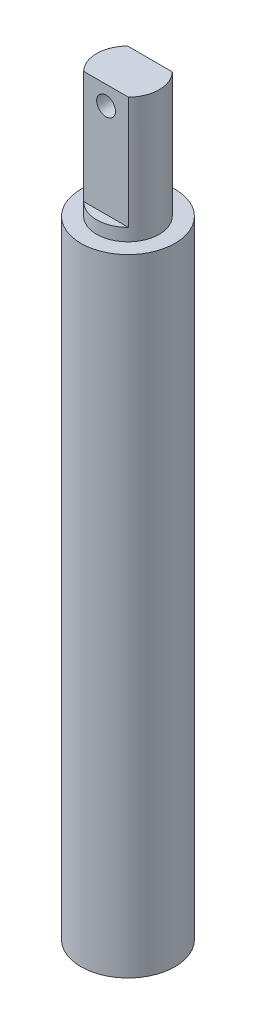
ISO-10303-21;
HEADER;
FILE_DESCRIPTION(('STEP AP214'),'2;1');
FILE_NAME('part.step','',(''),(''),'','','');
FILE_SCHEMA(('AUTOMOTIVE_DESIGN { 1 0 10303 214 1 1 1 1 }'));
ENDSEC;
DATA;
#1=APPLICATION_CONTEXT('core data for automotive mechanical design processes');
#2=APPLICATION_PROTOCOL_DEFINITION('international standard','automotive_design',2000,#1);
#3=PRODUCT_CONTEXT('',#1,'mechanical');
#4=PRODUCT('Part','Part','',(#3));
#5=PRODUCT_RELATED_PRODUCT_CATEGORY('part','',(#4));
#6=PRODUCT_DEFINITION_FORMATION('','',#4);
#7=PRODUCT_DEFINITION_CONTEXT('part definition',#1,'design');
#8=PRODUCT_DEFINITION('design','',#6,#7);
#9=PRODUCT_DEFINITION_SHAPE('','',#8);
#10=(LENGTH_UNIT() NAMED_UNIT(*) SI_UNIT(.MILLI.,.METRE.));
#11=(NAMED_UNIT(*) PLANE_ANGLE_UNIT() SI_UNIT($,.RADIAN.));
#12=(NAMED_UNIT(*) SI_UNIT($,.STERADIAN.) SOLID_ANGLE_UNIT());
#13=UNCERTAINTY_MEASURE_WITH_UNIT(LENGTH_MEASURE(1.E-05),#10,'distance_accuracy_value','');
#14=(GEOMETRIC_REPRESENTATION_CONTEXT(3) GLOBAL_UNCERTAINTY_ASSIGNED_CONTEXT((#13)) GLOBAL_UNIT_ASSIGNED_CONTEXT((#10,
#11,#12)) REPRESENTATION_CONTEXT('',''));
#15=CARTESIAN_POINT('',(0.,0.,0.));
#16=DIRECTION('',(0.,0.,1.));
#17=DIRECTION('',(1.,0.,0.));
#18=AXIS2_PLACEMENT_3D('',#15,#16,#17);
#19=CARTESIAN_POINT('',(0.,120.,0.));
#20=DIRECTION('',(0.,-1.,0.));
#21=DIRECTION('',(0.,0.,-1.));
#22=AXIS2_PLACEMENT_3D('',#19,#20,#21);
#23=CYLINDRICAL_SURFACE('',#22,5.);
#24=CARTESIAN_POINT('',(0.,100.,0.));
#25=DIRECTION('',(0.,1.,0.));
#26=DIRECTION('',(0.,0.,1.));
#27=AXIS2_PLACEMENT_3D('',#24,#25,#26);
#28=CIRCLE('',#27,5.);
#29=CARTESIAN_POINT('',(0.,100.,5.));
#30=VERTEX_POINT('',#29);
#31=EDGE_CURVE('E133',#30,#30,#28,.T.);
#32=ORIENTED_EDGE('',*,*,#31,.T.);
#33=EDGE_LOOP('',(#32));
#34=FACE_BOUND('',#33,.T.);
#35=DIRECTION('',(0.,-1.,0.));
#36=VECTOR('',#35,1.);
#37=CARTESIAN_POINT('',(3.57071421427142,120.,-3.5));
#38=LINE('',#37,#36);
#39=CARTESIAN_POINT('',(3.57071421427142,120.,-3.5));
#40=VERTEX_POINT('',#39);
#41=CARTESIAN_POINT('',(3.57071421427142,102.,-3.5));
#42=VERTEX_POINT('',#41);
#43=EDGE_CURVE('E120',#40,#42,#38,.T.);
#44=ORIENTED_EDGE('',*,*,#43,.F.);
#45=CARTESIAN_POINT('',(0.,120.,0.));
#46=DIRECTION('',(0.,1.,0.));
#47=DIRECTION('',(0.,0.,1.));
#48=AXIS2_PLACEMENT_3D('',#45,#46,#47);
#49=CIRCLE('',#48,5.);
#50=CARTESIAN_POINT('',(3.57071421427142,120.,3.5));
#51=VERTEX_POINT('',#50);
#52=EDGE_CURVE('E104',#51,#40,#49,.T.);
#53=ORIENTED_EDGE('',*,*,#52,.F.);
#54=DIRECTION('',(0.,-1.,0.));
#55=VECTOR('',#54,1.);
#56=CARTESIAN_POINT('',(3.57071421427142,120.,3.5));
#57=LINE('',#56,#55);
#58=CARTESIAN_POINT('',(3.57071421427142,102.,3.5));
#59=VERTEX_POINT('',#58);
#60=EDGE_CURVE('E76',#59,#51,#57,.F.);
#61=ORIENTED_EDGE('',*,*,#60,.F.);
#62=CARTESIAN_POINT('',(0.,102.,0.));
#63=DIRECTION('',(0.,1.,0.));
#64=DIRECTION('',(0.,0.,1.));
#65=AXIS2_PLACEMENT_3D('',#62,#63,#64);
#66=CIRCLE('',#65,5.);
#67=CARTESIAN_POINT('',(-3.57071421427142,102.,3.5));
#68=VERTEX_POINT('',#67);
#69=EDGE_CURVE('E61',#68,#59,#66,.T.);
#70=ORIENTED_EDGE('',*,*,#69,.F.);
#71=DIRECTION('',(0.,-1.,0.));
#72=VECTOR('',#71,1.);
#73=CARTESIAN_POINT('',(-3.57071421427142,120.,3.5));
#74=LINE('',#73,#72);
#75=CARTESIAN_POINT('',(-3.57071421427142,120.,3.5));
#76=VERTEX_POINT('',#75);
#77=EDGE_CURVE('E108',#76,#68,#74,.T.);
#78=ORIENTED_EDGE('',*,*,#77,.F.);
#79=CARTESIAN_POINT('',(-3.57071421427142,120.,-3.5));
#80=VERTEX_POINT('',#79);
#81=EDGE_CURVE('E96',#80,#76,#49,.T.);
#82=ORIENTED_EDGE('',*,*,#81,.F.);
#83=DIRECTION('',(0.,-1.,0.));
#84=VECTOR('',#83,1.);
#85=CARTESIAN_POINT('',(-3.57071421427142,120.,-3.5));
#86=LINE('',#85,#84);
#87=CARTESIAN_POINT('',(-3.57071421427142,102.,-3.5));
#88=VERTEX_POINT('',#87);
#89=EDGE_CURVE('E68',#88,#80,#86,.F.);
#90=ORIENTED_EDGE('',*,*,#89,.F.);
#91=EDGE_CURVE('E12',#42,#88,#66,.T.);
#92=ORIENTED_EDGE('',*,*,#91,.F.);
#93=EDGE_LOOP('',(#44,#53,#61,#70,#78,#82,#90,#92));
#94=FACE_BOUND('',#93,.T.);
#95=ADVANCED_FACE('F51',(#34,#94),#23,.T.);
#96=CARTESIAN_POINT('',(0.,120.,0.));
#97=DIRECTION('',(0.,1.,0.));
#98=DIRECTION('',(0.,0.,1.));
#99=AXIS2_PLACEMENT_3D('',#96,#97,#98);
#100=PLANE('',#99);
#101=ORIENTED_EDGE('',*,*,#52,.T.);
#102=DIRECTION('',(-1.,0.,0.));
#103=VECTOR('',#102,1.);
#104=CARTESIAN_POINT('',(0.,120.,-3.5));
#105=LINE('',#104,#103);
#106=EDGE_CURVE('E100',#40,#80,#105,.T.);
#107=ORIENTED_EDGE('',*,*,#106,.T.);
#108=ORIENTED_EDGE('',*,*,#81,.T.);
#109=DIRECTION('',(1.,0.,0.));
#110=VECTOR('',#109,1.);
#111=CARTESIAN_POINT('',(0.,120.,3.5));
#112=LINE('',#111,#110);
#113=EDGE_CURVE('E98',#76,#51,#112,.T.);
#114=ORIENTED_EDGE('',*,*,#113,.T.);
#115=EDGE_LOOP('',(#101,#107,#108,#114));
#116=FACE_BOUND('',#115,.T.);
#117=ADVANCED_FACE('F97',(#116),#100,.T.);
#118=CARTESIAN_POINT('',(0.,100.,0.));
#119=DIRECTION('',(0.,-1.,0.));
#120=DIRECTION('',(0.,0.,-1.));
#121=AXIS2_PLACEMENT_3D('',#118,#119,#120);
#122=CYLINDRICAL_SURFACE('',#121,5.);
#123=CARTESIAN_POINT('',(0.,0.,0.));
#124=DIRECTION('',(0.,1.,0.));
#125=DIRECTION('',(0.,0.,1.));
#126=AXIS2_PLACEMENT_3D('',#123,#124,#125);
#127=CIRCLE('',#126,5.);
#128=CARTESIAN_POINT('',(0.,0.,5.));
#129=VERTEX_POINT('',#128);
#130=EDGE_CURVE('E129',#129,#129,#127,.T.);
#131=ORIENTED_EDGE('',*,*,#130,.F.);
#132=EDGE_LOOP('',(#131));
#133=FACE_BOUND('',#132,.T.);
#134=CARTESIAN_POINT('',(0.,60.,0.));
#135=DIRECTION('',(0.,1.,0.));
#136=DIRECTION('',(0.,0.,1.));
#137=AXIS2_PLACEMENT_3D('',#134,#135,#136);
#138=CIRCLE('',#137,5.);
#139=CARTESIAN_POINT('',(0.,60.,5.));
#140=VERTEX_POINT('',#139);
#141=EDGE_CURVE('E105',#140,#140,#138,.T.);
#142=ORIENTED_EDGE('',*,*,#141,.T.);
#143=EDGE_LOOP('',(#142));
#144=FACE_BOUND('',#143,.T.);
#145=ADVANCED_FACE('F191',(#133,#144),#122,.F.);
#146=CARTESIAN_POINT('',(0.,100.,0.));
#147=DIRECTION('',(0.,1.,0.));
#148=DIRECTION('',(0.,0.,1.));
#149=AXIS2_PLACEMENT_3D('',#146,#147,#148);
#150=PLANE('',#149);
#151=CARTESIAN_POINT('',(0.,100.,0.));
#152=DIRECTION('',(0.,1.,0.));
#153=DIRECTION('',(0.,0.,1.));
#154=AXIS2_PLACEMENT_3D('',#151,#152,#153);
#155=CIRCLE('',#154,7.5);
#156=CARTESIAN_POINT('',(0.,100.,7.5));
#157=VERTEX_POINT('',#156);
#158=EDGE_CURVE('E111',#157,#157,#155,.T.);
#159=ORIENTED_EDGE('',*,*,#158,.T.);
#160=EDGE_LOOP('',(#159));
#161=FACE_BOUND('',#160,.T.);
#162=ORIENTED_EDGE('',*,*,#31,.F.);
#163=EDGE_LOOP('',(#162));
#164=FACE_BOUND('',#163,.T.);
#165=ADVANCED_FACE('F198',(#161,#164),#150,.T.);
#166=CARTESIAN_POINT('',(0.,0.,0.));
#167=DIRECTION('',(0.,1.,0.));
#168=DIRECTION('',(0.,0.,1.));
#169=AXIS2_PLACEMENT_3D('',#166,#167,#168);
#170=PLANE('',#169);
#171=CARTESIAN_POINT('',(0.,0.,0.));
#172=DIRECTION('',(0.,1.,0.));
#173=DIRECTION('',(0.,0.,1.));
#174=AXIS2_PLACEMENT_3D('',#171,#172,#173);
#175=CIRCLE('',#174,7.5);
#176=CARTESIAN_POINT('',(0.,0.,7.5));
#177=VERTEX_POINT('',#176);
#178=EDGE_CURVE('E137',#177,#177,#175,.T.);
#179=ORIENTED_EDGE('',*,*,#178,.F.);
#180=EDGE_LOOP('',(#179));
#181=FACE_BOUND('',#180,.T.);
#182=ORIENTED_EDGE('',*,*,#130,.T.);
#183=EDGE_LOOP('',(#182));
#184=FACE_BOUND('',#183,.T.);
#185=ADVANCED_FACE('F201',(#181,#184),#170,.F.);
#186=CARTESIAN_POINT('',(0.,100.,0.));
#187=DIRECTION('',(0.,-1.,0.));
#188=DIRECTION('',(0.,0.,-1.));
#189=AXIS2_PLACEMENT_3D('',#186,#187,#188);
#190=CYLINDRICAL_SURFACE('',#189,7.5);
#191=ORIENTED_EDGE('',*,*,#158,.F.);
#192=EDGE_LOOP('',(#191));
#193=FACE_BOUND('',#192,.T.);
#194=ORIENTED_EDGE('',*,*,#178,.T.);
#195=EDGE_LOOP('',(#194));
#196=FACE_BOUND('',#195,.T.);
#197=ADVANCED_FACE('F53',(#193,#196),#190,.T.);
#198=CARTESIAN_POINT('',(0.,60.,0.));
#199=DIRECTION('',(0.,1.,0.));
#200=DIRECTION('',(0.,0.,1.));
#201=AXIS2_PLACEMENT_3D('',#198,#199,#200);
#202=PLANE('',#201);
#203=ORIENTED_EDGE('',*,*,#141,.F.);
#204=EDGE_LOOP('',(#203));
#205=FACE_BOUND('',#204,.T.);
#206=ADVANCED_FACE('F195',(#205),#202,.F.);
#207=CARTESIAN_POINT('',(5.,102.,3.5));
#208=DIRECTION('',(0.,0.,1.));
#209=DIRECTION('',(1.,0.,0.));
#210=AXIS2_PLACEMENT_3D('',#207,#208,#209);
#211=PLANE('',#210);
#212=CARTESIAN_POINT('',(0.,117.,3.5));
#213=DIRECTION('',(0.,0.,1.));
#214=DIRECTION('',(1.,0.,0.));
#215=AXIS2_PLACEMENT_3D('',#212,#213,#214);
#216=CIRCLE('',#215,1.5);
#217=CARTESIAN_POINT('',(1.5,117.,3.5));
#218=VERTEX_POINT('',#217);
#219=EDGE_CURVE('E164',#218,#218,#216,.T.);
#220=ORIENTED_EDGE('',*,*,#219,.F.);
#221=EDGE_LOOP('',(#220));
#222=FACE_BOUND('',#221,.T.);
#223=ORIENTED_EDGE('',*,*,#77,.T.);
#224=DIRECTION('',(1.,0.,0.));
#225=VECTOR('',#224,1.);
#226=CARTESIAN_POINT('',(5.,102.,3.5));
#227=LINE('',#226,#225);
#228=EDGE_CURVE('E152',#68,#59,#227,.T.);
#229=ORIENTED_EDGE('',*,*,#228,.T.);
#230=ORIENTED_EDGE('',*,*,#60,.T.);
#231=ORIENTED_EDGE('',*,*,#113,.F.);
#232=EDGE_LOOP('',(#223,#229,#230,#231));
#233=FACE_BOUND('',#232,.T.);
#234=ADVANCED_FACE('F107',(#222,#233),#211,.T.);
#235=CARTESIAN_POINT('',(0.,102.,0.));
#236=DIRECTION('',(0.,1.,0.));
#237=DIRECTION('',(0.,0.,1.));
#238=AXIS2_PLACEMENT_3D('',#235,#236,#237);
#239=PLANE('',#238);
#240=ORIENTED_EDGE('',*,*,#69,.T.);
#241=ORIENTED_EDGE('',*,*,#228,.F.);
#242=EDGE_LOOP('',(#240,#241));
#243=FACE_BOUND('',#242,.T.);
#244=ADVANCED_FACE('F151',(#243),#239,.T.);
#245=ORIENTED_EDGE('',*,*,#91,.T.);
#246=DIRECTION('',(-1.,0.,0.));
#247=VECTOR('',#246,1.);
#248=CARTESIAN_POINT('',(5.,102.,-3.5));
#249=LINE('',#248,#247);
#250=EDGE_CURVE('E123',#42,#88,#249,.T.);
#251=ORIENTED_EDGE('',*,*,#250,.F.);
#252=EDGE_LOOP('',(#245,#251));
#253=FACE_BOUND('',#252,.T.);
#254=ADVANCED_FACE('F159',(#253),#239,.T.);
#255=CARTESIAN_POINT('',(5.,102.,-3.5));
#256=DIRECTION('',(0.,0.,-1.));
#257=DIRECTION('',(-1.,0.,0.));
#258=AXIS2_PLACEMENT_3D('',#255,#256,#257);
#259=PLANE('',#258);
#260=CARTESIAN_POINT('',(0.,117.,-3.5));
#261=DIRECTION('',(0.,0.,-1.));
#262=DIRECTION('',(-1.,0.,0.));
#263=AXIS2_PLACEMENT_3D('',#260,#261,#262);
#264=CIRCLE('',#263,1.5);
#265=CARTESIAN_POINT('',(-1.5,117.,-3.5));
#266=VERTEX_POINT('',#265);
#267=EDGE_CURVE('E55',#266,#266,#264,.T.);
#268=ORIENTED_EDGE('',*,*,#267,.F.);
#269=EDGE_LOOP('',(#268));
#270=FACE_BOUND('',#269,.T.);
#271=ORIENTED_EDGE('',*,*,#43,.T.);
#272=ORIENTED_EDGE('',*,*,#250,.T.);
#273=ORIENTED_EDGE('',*,*,#89,.T.);
#274=ORIENTED_EDGE('',*,*,#106,.F.);
#275=EDGE_LOOP('',(#271,#272,#273,#274));
#276=FACE_BOUND('',#275,.T.);
#277=ADVANCED_FACE('F156',(#270,#276),#259,.T.);
#278=CARTESIAN_POINT('',(0.,117.,-6.5));
#279=DIRECTION('',(0.,0.,1.));
#280=DIRECTION('',(1.,0.,0.));
#281=AXIS2_PLACEMENT_3D('',#278,#279,#280);
#282=CYLINDRICAL_SURFACE('',#281,1.5);
#283=ORIENTED_EDGE('',*,*,#267,.T.);
#284=EDGE_LOOP('',(#283));
#285=FACE_BOUND('',#284,.T.);
#286=ORIENTED_EDGE('',*,*,#219,.T.);
#287=EDGE_LOOP('',(#286));
#288=FACE_BOUND('',#287,.T.);
#289=ADVANCED_FACE('F174',(#285,#288),#282,.F.);
#290=CLOSED_SHELL('',(#95,#117,#145,#165,#185,#197,#206,#234,#244,#254,#277,#289));
#291=MANIFOLD_SOLID_BREP('B2',#290);
#292=ADVANCED_BREP_SHAPE_REPRESENTATION('',(#18,#291),#14);
#293=SHAPE_DEFINITION_REPRESENTATION(#9,#292);
ENDSEC;
END-ISO-10303-21;
